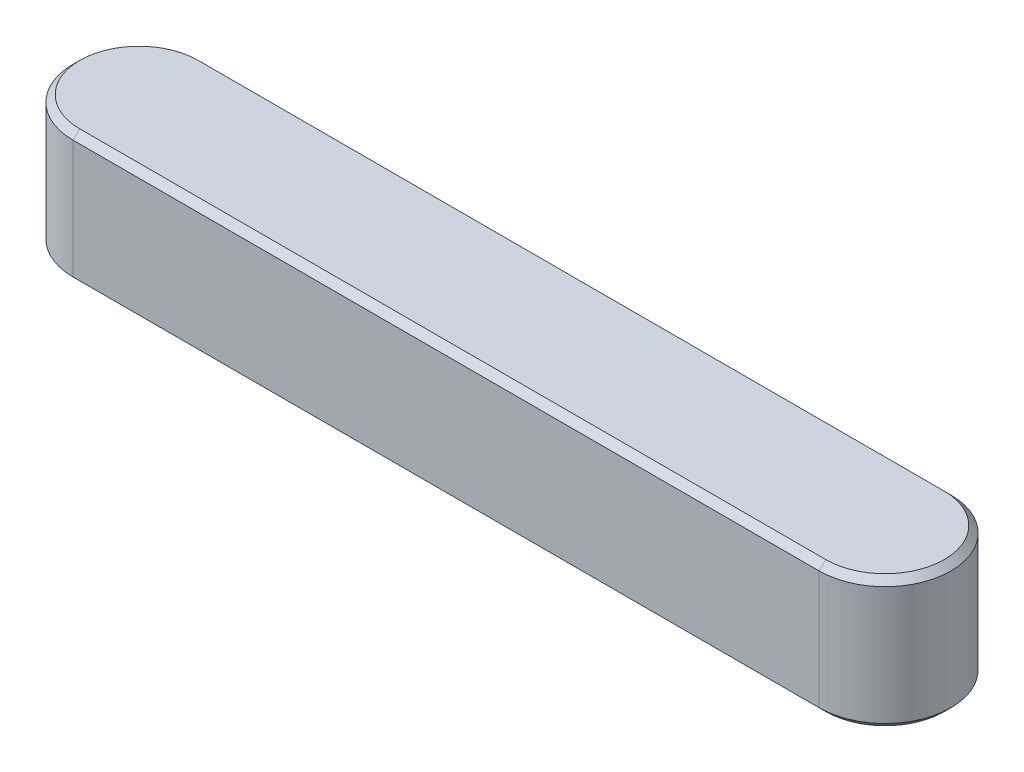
from build123d import *

# Parameters (mm, degrees)
BOSS_EXTRUDE1_DEPTH = 3
CHAMFER1_SIZE       = 0.15


with BuildPart() as part:
    # Sketch1 → Boss-Extrude1 (new body)
    with BuildSketch(Plane(origin=(0, 0, 0), x_dir=(1, 0, 0), z_dir=(0, 1, 0))):
        with BuildLine():
            Line((-8.5, 1.5), (8.5, 1.5))
            ThreePointArc((8.5, 1.5), (10, 0), (8.5, -1.5))
            Line((8.5, -1.5), (-8.5, -1.5))
            ThreePointArc((-8.5, -1.5), (-10, 0), (-8.5, 1.5))
        make_face()
    extrude(amount=BOSS_EXTRUDE1_DEPTH)

    # Chamfer1
    chamfer1_edges = [part.edges().sort_by_distance(p)[0] for p in [
        (10, 3, 0),
        (0, 3, -1.5),
        (-10, 3, 0),
        (0, 0, -1.5),
        (10, 0, 0),
        (0, 0, 1.5),
        (-10, 0, 0),
        (0, 3, 1.5),
    ]]
    chamfer(chamfer1_edges, length=CHAMFER1_SIZE)


solid = part.part
